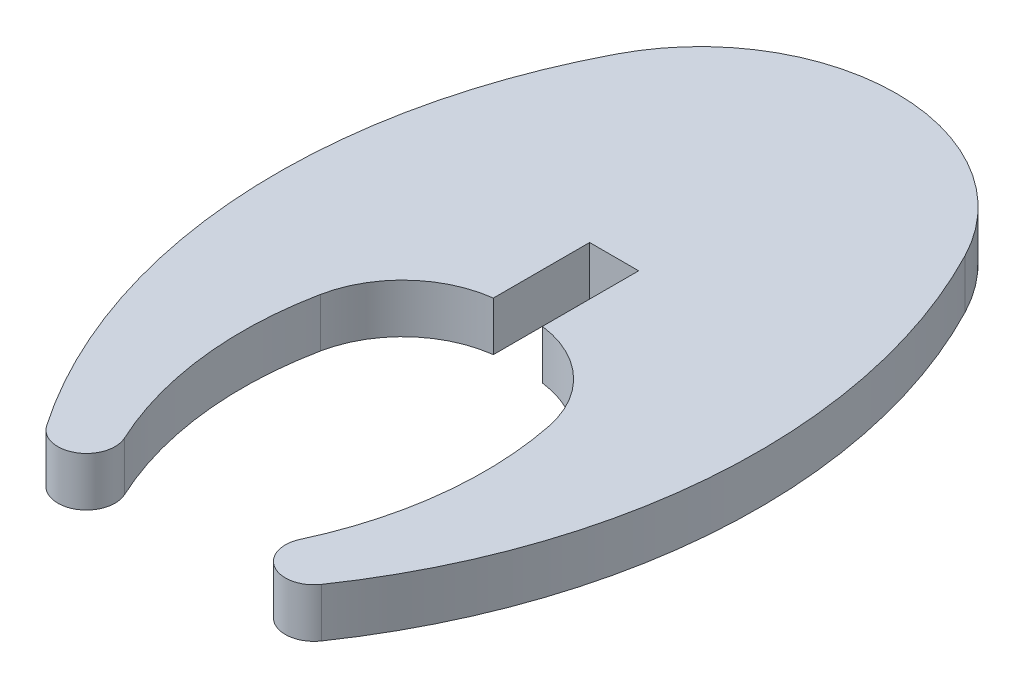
ISO-10303-21;
HEADER;
FILE_DESCRIPTION(('STEP AP214'),'2;1');
FILE_NAME('part.step','',(''),(''),'','','');
FILE_SCHEMA(('AUTOMOTIVE_DESIGN { 1 0 10303 214 1 1 1 1 }'));
ENDSEC;
DATA;
#1=APPLICATION_CONTEXT('core data for automotive mechanical design processes');
#2=APPLICATION_PROTOCOL_DEFINITION('international standard','automotive_design',2000,#1);
#3=PRODUCT_CONTEXT('',#1,'mechanical');
#4=PRODUCT('Part','Part','',(#3));
#5=PRODUCT_RELATED_PRODUCT_CATEGORY('part','',(#4));
#6=PRODUCT_DEFINITION_FORMATION('','',#4);
#7=PRODUCT_DEFINITION_CONTEXT('part definition',#1,'design');
#8=PRODUCT_DEFINITION('design','',#6,#7);
#9=PRODUCT_DEFINITION_SHAPE('','',#8);
#10=(LENGTH_UNIT() NAMED_UNIT(*) SI_UNIT(.MILLI.,.METRE.));
#11=(NAMED_UNIT(*) PLANE_ANGLE_UNIT() SI_UNIT($,.RADIAN.));
#12=(NAMED_UNIT(*) SI_UNIT($,.STERADIAN.) SOLID_ANGLE_UNIT());
#13=UNCERTAINTY_MEASURE_WITH_UNIT(LENGTH_MEASURE(1.E-05),#10,'distance_accuracy_value','');
#14=(GEOMETRIC_REPRESENTATION_CONTEXT(3) GLOBAL_UNCERTAINTY_ASSIGNED_CONTEXT((#13)) GLOBAL_UNIT_ASSIGNED_CONTEXT((#10,
#11,#12)) REPRESENTATION_CONTEXT('',''));
#15=CARTESIAN_POINT('',(0.,0.,0.));
#16=DIRECTION('',(0.,0.,1.));
#17=DIRECTION('',(1.,0.,0.));
#18=AXIS2_PLACEMENT_3D('',#15,#16,#17);
#19=CARTESIAN_POINT('',(-41998.0702575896,3.,-18196.3856532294));
#20=DIRECTION('',(0.,-1.,0.));
#21=DIRECTION('',(0.,0.,-1.));
#22=AXIS2_PLACEMENT_3D('',#19,#20,#21);
#23=CYLINDRICAL_SURFACE('',#22,36.1572377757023);
#24=CARTESIAN_POINT('',(-41998.0702575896,0.,-18196.3856532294));
#25=DIRECTION('',(0.,1.,0.));
#26=DIRECTION('',(0.,0.,1.));
#27=AXIS2_PLACEMENT_3D('',#24,#25,#26);
#28=CIRCLE('',#27,36.1572377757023);
#29=CARTESIAN_POINT('',(-41968.2504699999,0.,-18175.937521));
#30=VERTEX_POINT('',#29);
#31=CARTESIAN_POINT('',(-41965.989663,0.,-18213.064421));
#32=VERTEX_POINT('',#31);
#33=EDGE_CURVE('E156',#30,#32,#28,.T.);
#34=ORIENTED_EDGE('',*,*,#33,.T.);
#35=DIRECTION('',(0.,-1.,0.));
#36=VECTOR('',#35,1.);
#37=CARTESIAN_POINT('',(-41965.989663,3.,-18213.064421));
#38=LINE('',#37,#36);
#39=CARTESIAN_POINT('',(-41965.989663,3.,-18213.064421));
#40=VERTEX_POINT('',#39);
#41=EDGE_CURVE('E11',#40,#32,#38,.T.);
#42=ORIENTED_EDGE('',*,*,#41,.F.);
#43=CARTESIAN_POINT('',(-41998.0702575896,3.,-18196.3856532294));
#44=DIRECTION('',(0.,1.,0.));
#45=DIRECTION('',(0.,0.,1.));
#46=AXIS2_PLACEMENT_3D('',#43,#44,#45);
#47=CIRCLE('',#46,36.1572377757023);
#48=CARTESIAN_POINT('',(-41968.2504699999,3.,-18175.937521));
#49=VERTEX_POINT('',#48);
#50=EDGE_CURVE('E178',#49,#40,#47,.T.);
#51=ORIENTED_EDGE('',*,*,#50,.F.);
#52=DIRECTION('',(0.,-1.,0.));
#53=VECTOR('',#52,1.);
#54=CARTESIAN_POINT('',(-41968.2504699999,3.,-18175.937521));
#55=LINE('',#54,#53);
#56=EDGE_CURVE('E152',#49,#30,#55,.T.);
#57=ORIENTED_EDGE('',*,*,#56,.T.);
#58=EDGE_LOOP('',(#34,#42,#51,#57));
#59=FACE_BOUND('',#58,.T.);
#60=ADVANCED_FACE('F36',(#59),#23,.T.);
#61=CARTESIAN_POINT('',(-41976.6562495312,3.,-18207.5156249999));
#62=DIRECTION('',(0.,-1.,0.));
#63=DIRECTION('',(0.,0.,-1.));
#64=AXIS2_PLACEMENT_3D('',#61,#62,#63);
#65=CYLINDRICAL_SURFACE('',#64,12.0235271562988);
#66=CARTESIAN_POINT('',(-41976.6562495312,0.,-18207.5156249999));
#67=DIRECTION('',(0.,1.,0.));
#68=DIRECTION('',(0.,0.,1.));
#69=AXIS2_PLACEMENT_3D('',#66,#67,#68);
#70=CIRCLE('',#69,12.0235271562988);
#71=CARTESIAN_POINT('',(-41987.324131,0.,-18213.061931));
#72=VERTEX_POINT('',#71);
#73=EDGE_CURVE('E159',#32,#72,#70,.T.);
#74=ORIENTED_EDGE('',*,*,#73,.T.);
#75=DIRECTION('',(0.,-1.,0.));
#76=VECTOR('',#75,1.);
#77=CARTESIAN_POINT('',(-41987.324131,3.,-18213.061931));
#78=LINE('',#77,#76);
#79=CARTESIAN_POINT('',(-41987.324131,3.,-18213.061931));
#80=VERTEX_POINT('',#79);
#81=EDGE_CURVE('E44',#80,#72,#78,.T.);
#82=ORIENTED_EDGE('',*,*,#81,.F.);
#83=CARTESIAN_POINT('',(-41976.6562495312,3.,-18207.5156249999));
#84=DIRECTION('',(0.,1.,0.));
#85=DIRECTION('',(0.,0.,1.));
#86=AXIS2_PLACEMENT_3D('',#83,#84,#85);
#87=CIRCLE('',#86,12.0235271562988);
#88=EDGE_CURVE('E107',#40,#80,#87,.T.);
#89=ORIENTED_EDGE('',*,*,#88,.F.);
#90=ORIENTED_EDGE('',*,*,#41,.T.);
#91=EDGE_LOOP('',(#74,#82,#89,#90));
#92=FACE_BOUND('',#91,.T.);
#93=ADVANCED_FACE('F256',(#92),#65,.T.);
#94=CARTESIAN_POINT('',(-41955.2460944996,3.,-18196.3867271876));
#95=DIRECTION('',(0.,-1.,0.));
#96=DIRECTION('',(0.,0.,-1.));
#97=AXIS2_PLACEMENT_3D('',#94,#95,#96);
#98=CYLINDRICAL_SURFACE('',#97,36.1533241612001);
#99=CARTESIAN_POINT('',(-41955.2460944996,0.,-18196.3867271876));
#100=DIRECTION('',(0.,1.,0.));
#101=DIRECTION('',(0.,0.,1.));
#102=AXIS2_PLACEMENT_3D('',#99,#100,#101);
#103=CIRCLE('',#102,36.1533241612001);
#104=CARTESIAN_POINT('',(-41985.058644,0.,-18175.934961));
#105=VERTEX_POINT('',#104);
#106=EDGE_CURVE('E161',#72,#105,#103,.T.);
#107=ORIENTED_EDGE('',*,*,#106,.T.);
#108=DIRECTION('',(0.,-1.,0.));
#109=VECTOR('',#108,1.);
#110=CARTESIAN_POINT('',(-41985.058644,3.,-18175.934961));
#111=LINE('',#110,#109);
#112=CARTESIAN_POINT('',(-41985.058644,3.,-18175.934961));
#113=VERTEX_POINT('',#112);
#114=EDGE_CURVE('E197',#113,#105,#111,.T.);
#115=ORIENTED_EDGE('',*,*,#114,.F.);
#116=CARTESIAN_POINT('',(-41955.2460944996,3.,-18196.3867271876));
#117=DIRECTION('',(0.,1.,0.));
#118=DIRECTION('',(0.,0.,1.));
#119=AXIS2_PLACEMENT_3D('',#116,#117,#118);
#120=CIRCLE('',#119,36.1533241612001);
#121=EDGE_CURVE('E205',#80,#113,#120,.T.);
#122=ORIENTED_EDGE('',*,*,#121,.F.);
#123=ORIENTED_EDGE('',*,*,#81,.T.);
#124=EDGE_LOOP('',(#107,#115,#122,#123));
#125=FACE_BOUND('',#124,.T.);
#126=ADVANCED_FACE('F203',(#125),#98,.T.);
#127=CARTESIAN_POINT('',(-41983.6131363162,3.,-18176.9258634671));
#128=DIRECTION('',(0.,-1.,0.));
#129=DIRECTION('',(0.,0.,-1.));
#130=AXIS2_PLACEMENT_3D('',#127,#128,#129);
#131=CYLINDRICAL_SURFACE('',#130,1.75253535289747);
#132=CARTESIAN_POINT('',(-41983.6131363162,0.,-18176.9258634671));
#133=DIRECTION('',(0.,1.,0.));
#134=DIRECTION('',(0.,0.,1.));
#135=AXIS2_PLACEMENT_3D('',#132,#133,#134);
#136=CIRCLE('',#135,1.75253535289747);
#137=CARTESIAN_POINT('',(-41982.023946,0.,-18177.664683));
#138=VERTEX_POINT('',#137);
#139=EDGE_CURVE('E163',#105,#138,#136,.T.);
#140=ORIENTED_EDGE('',*,*,#139,.T.);
#141=DIRECTION('',(0.,-1.,0.));
#142=VECTOR('',#141,1.);
#143=CARTESIAN_POINT('',(-41982.023946,3.,-18177.664683));
#144=LINE('',#143,#142);
#145=CARTESIAN_POINT('',(-41982.023946,3.,-18177.664683));
#146=VERTEX_POINT('',#145);
#147=EDGE_CURVE('E194',#146,#138,#144,.T.);
#148=ORIENTED_EDGE('',*,*,#147,.F.);
#149=CARTESIAN_POINT('',(-41983.6131363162,3.,-18176.9258634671));
#150=DIRECTION('',(0.,1.,0.));
#151=DIRECTION('',(0.,0.,1.));
#152=AXIS2_PLACEMENT_3D('',#149,#150,#151);
#153=CIRCLE('',#152,1.75253535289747);
#154=EDGE_CURVE('E223',#113,#146,#153,.T.);
#155=ORIENTED_EDGE('',*,*,#154,.F.);
#156=ORIENTED_EDGE('',*,*,#114,.T.);
#157=EDGE_LOOP('',(#140,#148,#155,#156));
#158=FACE_BOUND('',#157,.T.);
#159=ADVANCED_FACE('F214',(#158),#131,.T.);
#160=CARTESIAN_POINT('',(-41962.121035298,3.,-18186.9331000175));
#161=DIRECTION('',(0.,-1.,0.));
#162=DIRECTION('',(0.,0.,-1.));
#163=AXIS2_PLACEMENT_3D('',#160,#161,#162);
#164=CYLINDRICAL_SURFACE('',#163,21.9551681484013);
#165=CARTESIAN_POINT('',(-41962.121035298,0.,-18186.9331000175));
#166=DIRECTION('',(0.,-1.,0.));
#167=DIRECTION('',(0.,0.,1.));
#168=AXIS2_PLACEMENT_3D('',#165,#166,#167);
#169=CIRCLE('',#168,21.9551681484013);
#170=CARTESIAN_POINT('',(-41983.641789,0.,-18191.278968));
#171=VERTEX_POINT('',#170);
#172=EDGE_CURVE('E165',#138,#171,#169,.T.);
#173=ORIENTED_EDGE('',*,*,#172,.T.);
#174=DIRECTION('',(0.,-1.,0.));
#175=VECTOR('',#174,1.);
#176=CARTESIAN_POINT('',(-41983.641789,3.,-18191.278968));
#177=LINE('',#176,#175);
#178=CARTESIAN_POINT('',(-41983.641789,3.,-18191.278968));
#179=VERTEX_POINT('',#178);
#180=EDGE_CURVE('E191',#179,#171,#177,.T.);
#181=ORIENTED_EDGE('',*,*,#180,.F.);
#182=CARTESIAN_POINT('',(-41962.121035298,3.,-18186.9331000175));
#183=DIRECTION('',(0.,-1.,0.));
#184=DIRECTION('',(0.,0.,1.));
#185=AXIS2_PLACEMENT_3D('',#182,#183,#184);
#186=CIRCLE('',#185,21.9551681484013);
#187=EDGE_CURVE('E220',#146,#179,#186,.T.);
#188=ORIENTED_EDGE('',*,*,#187,.F.);
#189=ORIENTED_EDGE('',*,*,#147,.T.);
#190=EDGE_LOOP('',(#173,#181,#188,#189));
#191=FACE_BOUND('',#190,.T.);
#192=ADVANCED_FACE('F218',(#191),#164,.F.);
#193=CARTESIAN_POINT('',(-41977.3659910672,3.,-18190.0147822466));
#194=DIRECTION('',(0.,-1.,0.));
#195=DIRECTION('',(0.,0.,-1.));
#196=AXIS2_PLACEMENT_3D('',#193,#194,#195);
#197=CYLINDRICAL_SURFACE('',#196,6.40185951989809);
#198=CARTESIAN_POINT('',(-41977.3659910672,0.,-18190.0147822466));
#199=DIRECTION('',(0.,-1.,0.));
#200=DIRECTION('',(0.,0.,1.));
#201=AXIS2_PLACEMENT_3D('',#198,#199,#200);
#202=CIRCLE('',#201,6.40185951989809);
#203=CARTESIAN_POINT('',(-41978.160978,0.,-18196.367089));
#204=VERTEX_POINT('',#203);
#205=EDGE_CURVE('E167',#171,#204,#202,.T.);
#206=ORIENTED_EDGE('',*,*,#205,.T.);
#207=DIRECTION('',(0.,-1.,0.));
#208=VECTOR('',#207,1.);
#209=CARTESIAN_POINT('',(-41978.160978,3.,-18196.367089));
#210=LINE('',#209,#208);
#211=CARTESIAN_POINT('',(-41978.160978,3.,-18196.367089));
#212=VERTEX_POINT('',#211);
#213=EDGE_CURVE('E188',#212,#204,#210,.T.);
#214=ORIENTED_EDGE('',*,*,#213,.F.);
#215=CARTESIAN_POINT('',(-41977.3659910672,3.,-18190.0147822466));
#216=DIRECTION('',(0.,-1.,0.));
#217=DIRECTION('',(0.,0.,1.));
#218=AXIS2_PLACEMENT_3D('',#215,#216,#217);
#219=CIRCLE('',#218,6.40185951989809);
#220=EDGE_CURVE('E222',#179,#212,#219,.T.);
#221=ORIENTED_EDGE('',*,*,#220,.F.);
#222=ORIENTED_EDGE('',*,*,#180,.T.);
#223=EDGE_LOOP('',(#206,#214,#221,#222));
#224=FACE_BOUND('',#223,.T.);
#225=ADVANCED_FACE('F269',(#224),#197,.F.);
#226=CARTESIAN_POINT('',(-41978.160978,3.,-18196.367089));
#227=DIRECTION('',(-0.999999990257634,0.,-0.000139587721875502));
#228=DIRECTION('',(-0.000139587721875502,0.,0.999999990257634));
#229=AXIS2_PLACEMENT_3D('',#226,#227,#228);
#230=PLANE('',#229);
#231=DIRECTION('',(0.000139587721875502,0.,-0.999999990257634));
#232=VECTOR('',#231,1.);
#233=CARTESIAN_POINT('',(-41978.160978,0.,-18196.367089));
#234=LINE('',#233,#232);
#235=CARTESIAN_POINT('',(-41978.160156,0.,-18202.255859));
#236=VERTEX_POINT('',#235);
#237=EDGE_CURVE('E169',#204,#236,#234,.T.);
#238=ORIENTED_EDGE('',*,*,#237,.T.);
#239=DIRECTION('',(0.,-1.,0.));
#240=VECTOR('',#239,1.);
#241=CARTESIAN_POINT('',(-41978.160156,3.,-18202.255859));
#242=LINE('',#241,#240);
#243=CARTESIAN_POINT('',(-41978.160156,3.,-18202.255859));
#244=VERTEX_POINT('',#243);
#245=EDGE_CURVE('E185',#244,#236,#242,.T.);
#246=ORIENTED_EDGE('',*,*,#245,.F.);
#247=DIRECTION('',(0.000139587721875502,0.,-0.999999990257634));
#248=VECTOR('',#247,1.);
#249=CARTESIAN_POINT('',(-41978.160978,3.,-18196.367089));
#250=LINE('',#249,#248);
#251=EDGE_CURVE('E225',#212,#244,#250,.T.);
#252=ORIENTED_EDGE('',*,*,#251,.F.);
#253=ORIENTED_EDGE('',*,*,#213,.T.);
#254=EDGE_LOOP('',(#238,#246,#252,#253));
#255=FACE_BOUND('',#254,.T.);
#256=ADVANCED_FACE('F272',(#255),#230,.F.);
#257=CARTESIAN_POINT('',(-41978.160156,3.,-18202.255859));
#258=DIRECTION('',(0.,0.,-1.));
#259=DIRECTION('',(-1.,0.,0.));
#260=AXIS2_PLACEMENT_3D('',#257,#258,#259);
#261=PLANE('',#260);
#262=DIRECTION('',(1.,0.,0.));
#263=VECTOR('',#262,1.);
#264=CARTESIAN_POINT('',(-41978.160156,0.,-18202.255859));
#265=LINE('',#264,#263);
#266=CARTESIAN_POINT('',(-41975.160156,0.,-18202.255859));
#267=VERTEX_POINT('',#266);
#268=EDGE_CURVE('E171',#236,#267,#265,.T.);
#269=ORIENTED_EDGE('',*,*,#268,.T.);
#270=DIRECTION('',(0.,-1.,0.));
#271=VECTOR('',#270,1.);
#272=CARTESIAN_POINT('',(-41975.160156,3.,-18202.255859));
#273=LINE('',#272,#271);
#274=CARTESIAN_POINT('',(-41975.160156,3.,-18202.255859));
#275=VERTEX_POINT('',#274);
#276=EDGE_CURVE('E182',#275,#267,#273,.T.);
#277=ORIENTED_EDGE('',*,*,#276,.F.);
#278=DIRECTION('',(1.,0.,0.));
#279=VECTOR('',#278,1.);
#280=CARTESIAN_POINT('',(-41978.160156,3.,-18202.255859));
#281=LINE('',#280,#279);
#282=EDGE_CURVE('E231',#244,#275,#281,.T.);
#283=ORIENTED_EDGE('',*,*,#282,.F.);
#284=ORIENTED_EDGE('',*,*,#245,.T.);
#285=EDGE_LOOP('',(#269,#277,#283,#284));
#286=FACE_BOUND('',#285,.T.);
#287=ADVANCED_FACE('F237',(#286),#261,.F.);
#288=CARTESIAN_POINT('',(-41975.160156,3.,-18202.255859));
#289=DIRECTION('',(1.,0.,-2.41325288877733E-12));
#290=DIRECTION('',(-2.41325288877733E-12,0.,-1.));
#291=AXIS2_PLACEMENT_3D('',#288,#289,#290);
#292=PLANE('',#291);
#293=DIRECTION('',(2.41325288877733E-12,0.,1.));
#294=VECTOR('',#293,1.);
#295=CARTESIAN_POINT('',(-41975.160156,0.,-18202.255859));
#296=LINE('',#295,#294);
#297=CARTESIAN_POINT('',(-41975.160156,0.,-18196.3671869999));
#298=VERTEX_POINT('',#297);
#299=EDGE_CURVE('E173',#267,#298,#296,.T.);
#300=ORIENTED_EDGE('',*,*,#299,.T.);
#301=DIRECTION('',(0.,-1.,0.));
#302=VECTOR('',#301,1.);
#303=CARTESIAN_POINT('',(-41975.160156,3.,-18196.3671869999));
#304=LINE('',#303,#302);
#305=CARTESIAN_POINT('',(-41975.160156,3.,-18196.3671869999));
#306=VERTEX_POINT('',#305);
#307=EDGE_CURVE('E147',#306,#298,#304,.T.);
#308=ORIENTED_EDGE('',*,*,#307,.F.);
#309=DIRECTION('',(2.41325288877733E-12,0.,1.));
#310=VECTOR('',#309,1.);
#311=CARTESIAN_POINT('',(-41975.160156,3.,-18202.255859));
#312=LINE('',#311,#310);
#313=EDGE_CURVE('E138',#275,#306,#312,.T.);
#314=ORIENTED_EDGE('',*,*,#313,.F.);
#315=ORIENTED_EDGE('',*,*,#276,.T.);
#316=EDGE_LOOP('',(#300,#308,#314,#315));
#317=FACE_BOUND('',#316,.T.);
#318=ADVANCED_FACE('F241',(#317),#292,.F.);
#319=CARTESIAN_POINT('',(-41975.9501292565,3.,-18190.0125629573));
#320=DIRECTION('',(0.,-1.,0.));
#321=DIRECTION('',(0.,0.,-1.));
#322=AXIS2_PLACEMENT_3D('',#319,#320,#321);
#323=CYLINDRICAL_SURFACE('',#322,6.40353843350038);
#324=CARTESIAN_POINT('',(-41975.9501292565,0.,-18190.0125629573));
#325=DIRECTION('',(0.,-1.,0.));
#326=DIRECTION('',(0.,0.,1.));
#327=AXIS2_PLACEMENT_3D('',#324,#325,#326);
#328=CIRCLE('',#327,6.40353843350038);
#329=CARTESIAN_POINT('',(-41969.673261,0.,-18191.279934));
#330=VERTEX_POINT('',#329);
#331=EDGE_CURVE('E146',#298,#330,#328,.T.);
#332=ORIENTED_EDGE('',*,*,#331,.T.);
#333=DIRECTION('',(0.,-1.,0.));
#334=VECTOR('',#333,1.);
#335=CARTESIAN_POINT('',(-41969.673261,3.,-18191.279934));
#336=LINE('',#335,#334);
#337=CARTESIAN_POINT('',(-41969.673261,3.,-18191.279934));
#338=VERTEX_POINT('',#337);
#339=EDGE_CURVE('E143',#338,#330,#336,.T.);
#340=ORIENTED_EDGE('',*,*,#339,.F.);
#341=CARTESIAN_POINT('',(-41975.9501292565,3.,-18190.0125629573));
#342=DIRECTION('',(0.,-1.,0.));
#343=DIRECTION('',(0.,0.,1.));
#344=AXIS2_PLACEMENT_3D('',#341,#342,#343);
#345=CIRCLE('',#344,6.40353843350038);
#346=EDGE_CURVE('E132',#306,#338,#345,.T.);
#347=ORIENTED_EDGE('',*,*,#346,.F.);
#348=ORIENTED_EDGE('',*,*,#307,.T.);
#349=EDGE_LOOP('',(#332,#340,#347,#348));
#350=FACE_BOUND('',#349,.T.);
#351=ADVANCED_FACE('F144',(#350),#323,.F.);
#352=CARTESIAN_POINT('',(-41991.1918414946,3.,-18186.9299221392));
#353=DIRECTION('',(0.,-1.,0.));
#354=DIRECTION('',(0.,0.,-1.));
#355=AXIS2_PLACEMENT_3D('',#352,#353,#354);
#356=CYLINDRICAL_SURFACE('',#355,21.9538586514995);
#357=CARTESIAN_POINT('',(-41991.1918414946,0.,-18186.9299221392));
#358=DIRECTION('',(0.,-1.,0.));
#359=DIRECTION('',(0.,0.,1.));
#360=AXIS2_PLACEMENT_3D('',#357,#358,#359);
#361=CIRCLE('',#360,21.9538586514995);
#362=CARTESIAN_POINT('',(-41971.287793,0.,-18177.667052));
#363=VERTEX_POINT('',#362);
#364=EDGE_CURVE('E93',#330,#363,#361,.T.);
#365=ORIENTED_EDGE('',*,*,#364,.T.);
#366=DIRECTION('',(0.,-1.,0.));
#367=VECTOR('',#366,1.);
#368=CARTESIAN_POINT('',(-41971.287793,3.,-18177.667052));
#369=LINE('',#368,#367);
#370=CARTESIAN_POINT('',(-41971.287793,3.,-18177.667052));
#371=VERTEX_POINT('',#370);
#372=EDGE_CURVE('E148',#371,#363,#369,.T.);
#373=ORIENTED_EDGE('',*,*,#372,.F.);
#374=CARTESIAN_POINT('',(-41991.1918414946,3.,-18186.9299221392));
#375=DIRECTION('',(0.,-1.,0.));
#376=DIRECTION('',(0.,0.,1.));
#377=AXIS2_PLACEMENT_3D('',#374,#375,#376);
#378=CIRCLE('',#377,21.9538586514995);
#379=EDGE_CURVE('E136',#338,#371,#378,.T.);
#380=ORIENTED_EDGE('',*,*,#379,.F.);
#381=ORIENTED_EDGE('',*,*,#339,.T.);
#382=EDGE_LOOP('',(#365,#373,#380,#381));
#383=FACE_BOUND('',#382,.T.);
#384=ADVANCED_FACE('F150',(#383),#356,.F.);
#385=CARTESIAN_POINT('',(-41969.6962743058,3.,-18176.9302349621));
#386=DIRECTION('',(0.,-1.,0.));
#387=DIRECTION('',(0.,0.,-1.));
#388=AXIS2_PLACEMENT_3D('',#385,#386,#387);
#389=CYLINDRICAL_SURFACE('',#388,1.75380475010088);
#390=CARTESIAN_POINT('',(-41969.6962743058,0.,-18176.9302349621));
#391=DIRECTION('',(0.,1.,0.));
#392=DIRECTION('',(0.,0.,1.));
#393=AXIS2_PLACEMENT_3D('',#390,#391,#392);
#394=CIRCLE('',#393,1.75380475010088);
#395=EDGE_CURVE('E99',#363,#30,#394,.T.);
#396=ORIENTED_EDGE('',*,*,#395,.T.);
#397=ORIENTED_EDGE('',*,*,#56,.F.);
#398=CARTESIAN_POINT('',(-41969.6962743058,3.,-18176.9302349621));
#399=DIRECTION('',(0.,1.,0.));
#400=DIRECTION('',(0.,0.,1.));
#401=AXIS2_PLACEMENT_3D('',#398,#399,#400);
#402=CIRCLE('',#401,1.75380475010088);
#403=EDGE_CURVE('E52',#371,#49,#402,.T.);
#404=ORIENTED_EDGE('',*,*,#403,.F.);
#405=ORIENTED_EDGE('',*,*,#372,.T.);
#406=EDGE_LOOP('',(#396,#397,#404,#405));
#407=FACE_BOUND('',#406,.T.);
#408=ADVANCED_FACE('F245',(#407),#389,.T.);
#409=CARTESIAN_POINT('',(-41998.0702575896,3.,-18196.3856532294));
#410=DIRECTION('',(0.,1.,0.));
#411=DIRECTION('',(0.,0.,1.));
#412=AXIS2_PLACEMENT_3D('',#409,#410,#411);
#413=PLANE('',#412);
#414=ORIENTED_EDGE('',*,*,#50,.T.);
#415=ORIENTED_EDGE('',*,*,#88,.T.);
#416=ORIENTED_EDGE('',*,*,#121,.T.);
#417=ORIENTED_EDGE('',*,*,#154,.T.);
#418=ORIENTED_EDGE('',*,*,#187,.T.);
#419=ORIENTED_EDGE('',*,*,#220,.T.);
#420=ORIENTED_EDGE('',*,*,#251,.T.);
#421=ORIENTED_EDGE('',*,*,#282,.T.);
#422=ORIENTED_EDGE('',*,*,#313,.T.);
#423=ORIENTED_EDGE('',*,*,#346,.T.);
#424=ORIENTED_EDGE('',*,*,#379,.T.);
#425=ORIENTED_EDGE('',*,*,#403,.T.);
#426=EDGE_LOOP('',(#414,#415,#416,#417,#418,#419,#420,#421,#422,#423,#424,#425));
#427=FACE_BOUND('',#426,.T.);
#428=ADVANCED_FACE('F134',(#427),#413,.T.);
#429=CARTESIAN_POINT('',(-41998.0702575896,0.,-18196.3856532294));
#430=DIRECTION('',(0.,1.,0.));
#431=DIRECTION('',(0.,0.,1.));
#432=AXIS2_PLACEMENT_3D('',#429,#430,#431);
#433=PLANE('',#432);
#434=ORIENTED_EDGE('',*,*,#33,.F.);
#435=ORIENTED_EDGE('',*,*,#395,.F.);
#436=ORIENTED_EDGE('',*,*,#364,.F.);
#437=ORIENTED_EDGE('',*,*,#331,.F.);
#438=ORIENTED_EDGE('',*,*,#299,.F.);
#439=ORIENTED_EDGE('',*,*,#268,.F.);
#440=ORIENTED_EDGE('',*,*,#237,.F.);
#441=ORIENTED_EDGE('',*,*,#205,.F.);
#442=ORIENTED_EDGE('',*,*,#172,.F.);
#443=ORIENTED_EDGE('',*,*,#139,.F.);
#444=ORIENTED_EDGE('',*,*,#106,.F.);
#445=ORIENTED_EDGE('',*,*,#73,.F.);
#446=EDGE_LOOP('',(#434,#435,#436,#437,#438,#439,#440,#441,#442,#443,#444,#445));
#447=FACE_BOUND('',#446,.T.);
#448=ADVANCED_FACE('F209',(#447),#433,.F.);
#449=CLOSED_SHELL('',(#60,#93,#126,#159,#192,#225,#256,#287,#318,#351,#384,#408,#428,#448));
#450=MANIFOLD_SOLID_BREP('B2',#449);
#451=ADVANCED_BREP_SHAPE_REPRESENTATION('',(#18,#450),#14);
#452=SHAPE_DEFINITION_REPRESENTATION(#9,#451);
ENDSEC;
END-ISO-10303-21;
